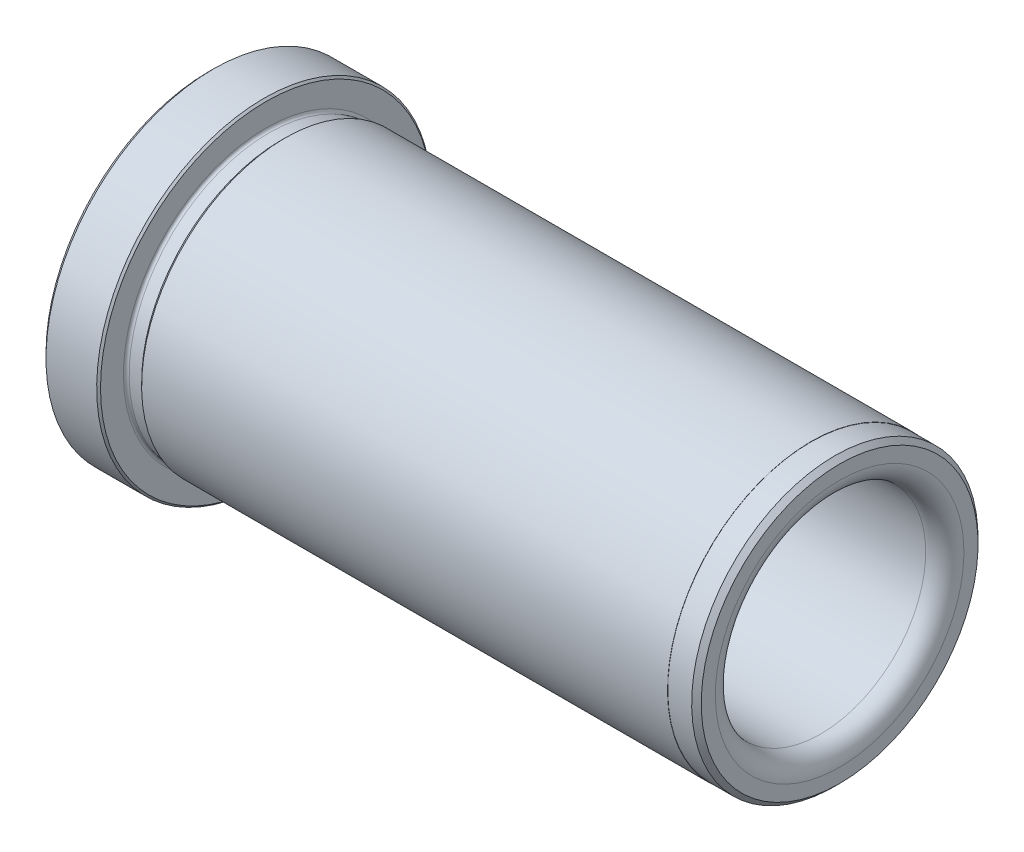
from build123d import *

# Parameters (mm, degrees)
SKETCH2_R      = 11
EXTRUDE1_DEPTH = 76
FILLET2_R      = 2
CHAMFER3_SIZE  = 0.5
CHAMFER4_SIZE  = 0.2


with BuildPart() as part:
    # Sketch1 → Revolve1 (revolve)
    with BuildSketch(Plane.XY):
        with BuildLine():
            Line((33, 14.975), (30, 14.975))
            Line((30, 14.975), (30, 15))
            Line((30, 15), (-25, 15))
            Line((-25, 15), (-25.4, 14.6))
            Line((-25.4, 14.6), (-26.7, 14.6))
            ThreePointArc((-26.7, 14.6), (-26.912132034, 14.687867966), (-27, 14.9))
            Line((-27, 14.9), (-27, 17.5))
            Line((-27, 17.5), (-33, 17.5))
            Line((-33, 17.5), (-33, 0))
            Line((-33, 0), (33, 0))
            Line((33, 0), (33, 14.975))
        make_face()
    revolve(axis=Axis((33, 0, 0), (-1, 0, 0)))

    # Sketch2 → Extrude1 (cut)
    with BuildSketch(Plane(origin=(33, 0, 0), x_dir=(0, 0, -1), z_dir=(1, 0, 0))):
        with Locations(Location((0, 0, 0), (0, 0, 90))):
            Circle(SKETCH2_R)
    extrude(amount=-EXTRUDE1_DEPTH, mode=Mode.SUBTRACT)

    # Fillet2
    fillet2_edges = [part.edges().sort_by_distance(p)[0] for p in [
        (33, -11, 0),
    ]]
    fillet(fillet2_edges, radius=FILLET2_R)

    # Chamfer3
    chamfer3_edges = [part.edges().sort_by_distance(p)[0] for p in [
        (-33, -11, 0),
        (-33, -17.5, 0),
        (33, -14.975, 0),
    ]]
    chamfer(chamfer3_edges, length=CHAMFER3_SIZE)

    # Chamfer4
    chamfer4_edges = [part.edges().sort_by_distance(p)[0] for p in [
        (-27, -17.5, 0),
    ]]
    chamfer(chamfer4_edges, length=CHAMFER4_SIZE)


solid = part.part
